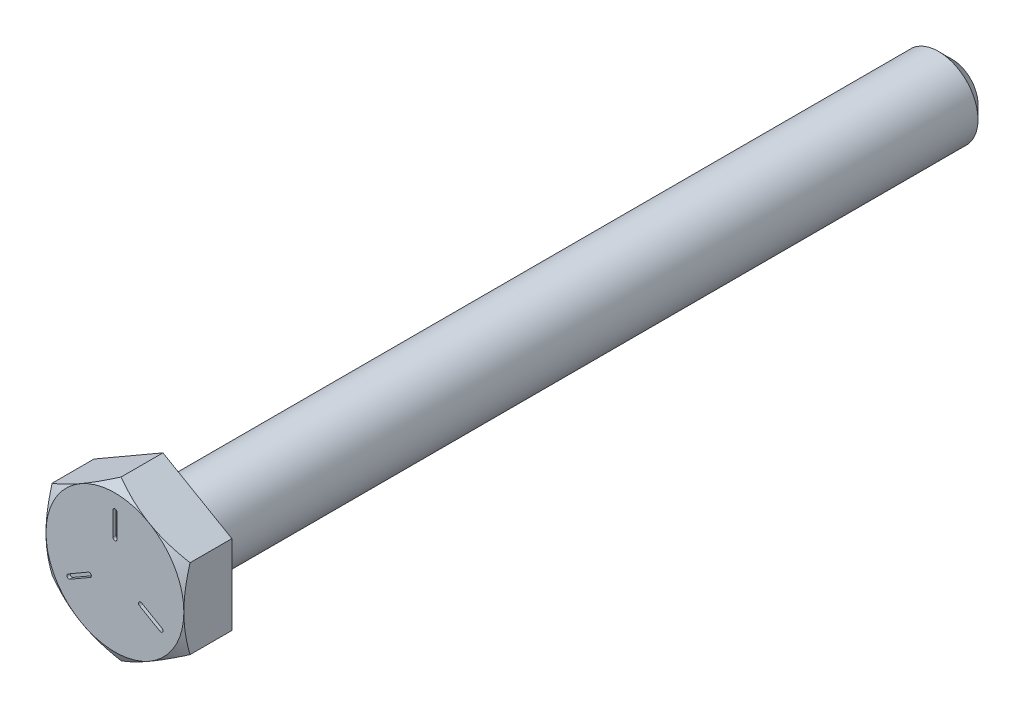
ISO-10303-21;
HEADER;
FILE_DESCRIPTION(('STEP AP214'),'2;1');
FILE_NAME('part.step','',(''),(''),'','','');
FILE_SCHEMA(('AUTOMOTIVE_DESIGN { 1 0 10303 214 1 1 1 1 }'));
ENDSEC;
DATA;
#1=APPLICATION_CONTEXT('core data for automotive mechanical design processes');
#2=APPLICATION_PROTOCOL_DEFINITION('international standard','automotive_design',2000,#1);
#3=PRODUCT_CONTEXT('',#1,'mechanical');
#4=PRODUCT('Part','Part','',(#3));
#5=PRODUCT_RELATED_PRODUCT_CATEGORY('part','',(#4));
#6=PRODUCT_DEFINITION_FORMATION('','',#4);
#7=PRODUCT_DEFINITION_CONTEXT('part definition',#1,'design');
#8=PRODUCT_DEFINITION('design','',#6,#7);
#9=PRODUCT_DEFINITION_SHAPE('','',#8);
#10=(LENGTH_UNIT() NAMED_UNIT(*) SI_UNIT(.MILLI.,.METRE.));
#11=(NAMED_UNIT(*) PLANE_ANGLE_UNIT() SI_UNIT($,.RADIAN.));
#12=(NAMED_UNIT(*) SI_UNIT($,.STERADIAN.) SOLID_ANGLE_UNIT());
#13=UNCERTAINTY_MEASURE_WITH_UNIT(LENGTH_MEASURE(1.E-05),#10,'distance_accuracy_value','');
#14=(GEOMETRIC_REPRESENTATION_CONTEXT(3) GLOBAL_UNCERTAINTY_ASSIGNED_CONTEXT((#13)) GLOBAL_UNIT_ASSIGNED_CONTEXT((#10,
#11,#12)) REPRESENTATION_CONTEXT('',''));
#15=CARTESIAN_POINT('',(0.,0.,0.));
#16=DIRECTION('',(0.,0.,1.));
#17=DIRECTION('',(1.,0.,0.));
#18=AXIS2_PLACEMENT_3D('',#15,#16,#17);
#19=CARTESIAN_POINT('',(-3.7051273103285,-2.13915625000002,33.480375));
#20=DIRECTION('',(0.,0.,1.));
#21=DIRECTION('',(1.,0.,0.));
#22=AXIS2_PLACEMENT_3D('',#19,#20,#21);
#23=PLANE('',#22);
#24=CARTESIAN_POINT('',(-2.06909706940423,-1.19459375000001,33.480375));
#25=DIRECTION('',(0.,0.,1.));
#26=DIRECTION('',(1.,0.,0.));
#27=AXIS2_PLACEMENT_3D('',#24,#25,#26);
#28=CIRCLE('',#27,0.1666875);
#29=CARTESIAN_POINT('',(-1.98575331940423,-1.33894935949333,33.480375));
#30=VERTEX_POINT('',#29);
#31=CARTESIAN_POINT('',(-2.15244081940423,-1.05023814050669,33.480375));
#32=VERTEX_POINT('',#31);
#33=EDGE_CURVE('E170',#30,#32,#28,.T.);
#34=ORIENTED_EDGE('',*,*,#33,.T.);
#35=DIRECTION('',(-0.866025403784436,-0.500000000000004,0.));
#36=VECTOR('',#35,1.);
#37=CARTESIAN_POINT('',(-3.7884710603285,-1.9948006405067,33.480375));
#38=LINE('',#37,#36);
#39=CARTESIAN_POINT('',(-3.7884710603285,-1.9948006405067,33.480375));
#40=VERTEX_POINT('',#39);
#41=EDGE_CURVE('E159',#32,#40,#38,.T.);
#42=ORIENTED_EDGE('',*,*,#41,.T.);
#43=CARTESIAN_POINT('',(-3.7051273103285,-2.13915625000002,33.480375));
#44=DIRECTION('',(0.,0.,1.));
#45=DIRECTION('',(1.,0.,0.));
#46=AXIS2_PLACEMENT_3D('',#43,#44,#45);
#47=CIRCLE('',#46,0.1666875);
#48=CARTESIAN_POINT('',(-3.6217835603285,-2.28351185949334,33.480375));
#49=VERTEX_POINT('',#48);
#50=EDGE_CURVE('E18',#40,#49,#47,.T.);
#51=ORIENTED_EDGE('',*,*,#50,.T.);
#52=DIRECTION('',(0.866025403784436,0.500000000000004,0.));
#53=VECTOR('',#52,1.);
#54=CARTESIAN_POINT('',(-3.6217835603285,-2.28351185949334,33.480375));
#55=LINE('',#54,#53);
#56=EDGE_CURVE('E156',#49,#30,#55,.T.);
#57=ORIENTED_EDGE('',*,*,#56,.T.);
#58=EDGE_LOOP('',(#34,#42,#51,#57));
#59=FACE_BOUND('',#58,.T.);
#60=ADVANCED_FACE('F15',(#59),#23,.T.);
#61=CARTESIAN_POINT('',(3.70512731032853,-2.13915624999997,33.480375));
#62=DIRECTION('',(0.,0.,1.));
#63=DIRECTION('',(1.,0.,0.));
#64=AXIS2_PLACEMENT_3D('',#61,#62,#63);
#65=PLANE('',#64);
#66=CARTESIAN_POINT('',(2.06909706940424,-1.19459374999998,33.480375));
#67=DIRECTION('',(0.,0.,1.));
#68=DIRECTION('',(1.,0.,0.));
#69=AXIS2_PLACEMENT_3D('',#66,#67,#68);
#70=CIRCLE('',#69,0.1666875);
#71=CARTESIAN_POINT('',(2.15244081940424,-1.05023814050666,33.480375));
#72=VERTEX_POINT('',#71);
#73=CARTESIAN_POINT('',(1.98575331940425,-1.3389493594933,33.480375));
#74=VERTEX_POINT('',#73);
#75=EDGE_CURVE('E289',#72,#74,#70,.T.);
#76=ORIENTED_EDGE('',*,*,#75,.T.);
#77=DIRECTION('',(0.866025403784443,-0.499999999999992,0.));
#78=VECTOR('',#77,1.);
#79=CARTESIAN_POINT('',(3.62178356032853,-2.28351185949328,33.480375));
#80=LINE('',#79,#78);
#81=CARTESIAN_POINT('',(3.62178356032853,-2.28351185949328,33.480375));
#82=VERTEX_POINT('',#81);
#83=EDGE_CURVE('E180',#74,#82,#80,.T.);
#84=ORIENTED_EDGE('',*,*,#83,.T.);
#85=CARTESIAN_POINT('',(3.70512731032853,-2.13915624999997,33.480375));
#86=DIRECTION('',(0.,0.,1.));
#87=DIRECTION('',(1.,0.,0.));
#88=AXIS2_PLACEMENT_3D('',#85,#86,#87);
#89=CIRCLE('',#88,0.1666875);
#90=CARTESIAN_POINT('',(3.78847106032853,-1.99480064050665,33.480375));
#91=VERTEX_POINT('',#90);
#92=EDGE_CURVE('E176',#82,#91,#89,.T.);
#93=ORIENTED_EDGE('',*,*,#92,.T.);
#94=DIRECTION('',(-0.866025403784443,0.499999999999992,0.));
#95=VECTOR('',#94,1.);
#96=CARTESIAN_POINT('',(3.78847106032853,-1.99480064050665,33.480375));
#97=LINE('',#96,#95);
#98=EDGE_CURVE('E306',#91,#72,#97,.T.);
#99=ORIENTED_EDGE('',*,*,#98,.T.);
#100=EDGE_LOOP('',(#76,#84,#93,#99));
#101=FACE_BOUND('',#100,.T.);
#102=ADVANCED_FACE('F325',(#101),#65,.T.);
#103=CARTESIAN_POINT('',(0.,4.2783125,33.480375));
#104=DIRECTION('',(0.,0.,1.));
#105=DIRECTION('',(1.,0.,0.));
#106=AXIS2_PLACEMENT_3D('',#103,#104,#105);
#107=PLANE('',#106);
#108=CARTESIAN_POINT('',(0.,2.3891875,33.480375));
#109=DIRECTION('',(0.,0.,1.));
#110=DIRECTION('',(1.,0.,0.));
#111=AXIS2_PLACEMENT_3D('',#108,#109,#110);
#112=CIRCLE('',#111,0.1666875);
#113=CARTESIAN_POINT('',(-0.1666875,2.3891875,33.480375));
#114=VERTEX_POINT('',#113);
#115=CARTESIAN_POINT('',(0.1666875,2.3891875,33.480375));
#116=VERTEX_POINT('',#115);
#117=EDGE_CURVE('E281',#114,#116,#112,.T.);
#118=ORIENTED_EDGE('',*,*,#117,.T.);
#119=DIRECTION('',(0.,1.,0.));
#120=VECTOR('',#119,1.);
#121=CARTESIAN_POINT('',(0.1666875,4.2783125,33.480375));
#122=LINE('',#121,#120);
#123=CARTESIAN_POINT('',(0.1666875,4.2783125,33.480375));
#124=VERTEX_POINT('',#123);
#125=EDGE_CURVE('E287',#116,#124,#122,.T.);
#126=ORIENTED_EDGE('',*,*,#125,.T.);
#127=CARTESIAN_POINT('',(0.,4.2783125,33.480375));
#128=DIRECTION('',(0.,0.,1.));
#129=DIRECTION('',(1.,0.,0.));
#130=AXIS2_PLACEMENT_3D('',#127,#128,#129);
#131=CIRCLE('',#130,0.1666875);
#132=CARTESIAN_POINT('',(-0.1666875,4.2783125,33.480375));
#133=VERTEX_POINT('',#132);
#134=EDGE_CURVE('E285',#124,#133,#131,.T.);
#135=ORIENTED_EDGE('',*,*,#134,.T.);
#136=DIRECTION('',(0.,-1.,0.));
#137=VECTOR('',#136,1.);
#138=CARTESIAN_POINT('',(-0.1666875,4.2783125,33.480375));
#139=LINE('',#138,#137);
#140=EDGE_CURVE('E303',#133,#114,#139,.T.);
#141=ORIENTED_EDGE('',*,*,#140,.T.);
#142=EDGE_LOOP('',(#118,#126,#135,#141));
#143=FACE_BOUND('',#142,.T.);
#144=ADVANCED_FACE('F446',(#143),#107,.T.);
#145=CARTESIAN_POINT('',(-3.7051273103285,-2.13915625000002,33.480375));
#146=DIRECTION('',(0.,0.,1.));
#147=DIRECTION('',(1.,0.,0.));
#148=AXIS2_PLACEMENT_3D('',#145,#146,#147);
#149=CYLINDRICAL_SURFACE('',#148,0.1666875);
#150=DIRECTION('',(0.,0.,1.));
#151=VECTOR('',#150,1.);
#152=CARTESIAN_POINT('',(-3.6217835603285,-2.28351185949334,33.480375));
#153=LINE('',#152,#151);
#154=CARTESIAN_POINT('',(-3.6217835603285,-2.28351185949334,33.734375));
#155=VERTEX_POINT('',#154);
#156=EDGE_CURVE('E163',#155,#49,#153,.F.);
#157=ORIENTED_EDGE('',*,*,#156,.T.);
#158=ORIENTED_EDGE('',*,*,#50,.F.);
#159=DIRECTION('',(0.,0.,1.));
#160=VECTOR('',#159,1.);
#161=CARTESIAN_POINT('',(-3.7884710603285,-1.9948006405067,33.480375));
#162=LINE('',#161,#160);
#163=CARTESIAN_POINT('',(-3.7884710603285,-1.9948006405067,33.734375));
#164=VERTEX_POINT('',#163);
#165=EDGE_CURVE('E183',#40,#164,#162,.T.);
#166=ORIENTED_EDGE('',*,*,#165,.T.);
#167=CARTESIAN_POINT('',(-3.7051273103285,-2.13915625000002,33.734375));
#168=DIRECTION('',(0.,0.,1.));
#169=DIRECTION('',(1.,0.,0.));
#170=AXIS2_PLACEMENT_3D('',#167,#168,#169);
#171=CIRCLE('',#170,0.1666875);
#172=EDGE_CURVE('E166',#155,#164,#171,.F.);
#173=ORIENTED_EDGE('',*,*,#172,.F.);
#174=EDGE_LOOP('',(#157,#158,#166,#173));
#175=FACE_BOUND('',#174,.T.);
#176=ADVANCED_FACE('F164',(#175),#149,.F.);
#177=CARTESIAN_POINT('',(-3.7884710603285,-1.9948006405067,33.480375));
#178=DIRECTION('',(-0.500000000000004,0.866025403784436,0.));
#179=DIRECTION('',(-0.866025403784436,-0.500000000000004,0.));
#180=AXIS2_PLACEMENT_3D('',#177,#178,#179);
#181=PLANE('',#180);
#182=ORIENTED_EDGE('',*,*,#165,.F.);
#183=ORIENTED_EDGE('',*,*,#41,.F.);
#184=DIRECTION('',(0.,0.,1.));
#185=VECTOR('',#184,1.);
#186=CARTESIAN_POINT('',(-2.15244081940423,-1.05023814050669,33.480375));
#187=LINE('',#186,#185);
#188=CARTESIAN_POINT('',(-2.15244081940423,-1.05023814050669,33.734375));
#189=VERTEX_POINT('',#188);
#190=EDGE_CURVE('E294',#32,#189,#187,.T.);
#191=ORIENTED_EDGE('',*,*,#190,.T.);
#192=DIRECTION('',(0.866025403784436,0.500000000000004,0.));
#193=VECTOR('',#192,1.);
#194=CARTESIAN_POINT('',(-3.7884710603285,-1.9948006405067,33.734375));
#195=LINE('',#194,#193);
#196=EDGE_CURVE('E278',#164,#189,#195,.T.);
#197=ORIENTED_EDGE('',*,*,#196,.F.);
#198=EDGE_LOOP('',(#182,#183,#191,#197));
#199=FACE_BOUND('',#198,.T.);
#200=ADVANCED_FACE('F453',(#199),#181,.F.);
#201=CARTESIAN_POINT('',(-2.06909706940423,-1.19459375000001,33.480375));
#202=DIRECTION('',(0.,0.,1.));
#203=DIRECTION('',(1.,0.,0.));
#204=AXIS2_PLACEMENT_3D('',#201,#202,#203);
#205=CYLINDRICAL_SURFACE('',#204,0.1666875);
#206=ORIENTED_EDGE('',*,*,#33,.F.);
#207=DIRECTION('',(0.,0.,1.));
#208=VECTOR('',#207,1.);
#209=CARTESIAN_POINT('',(-1.98575331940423,-1.33894935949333,33.480375));
#210=LINE('',#209,#208);
#211=CARTESIAN_POINT('',(-1.98575331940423,-1.33894935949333,33.734375));
#212=VERTEX_POINT('',#211);
#213=EDGE_CURVE('E174',#30,#212,#210,.T.);
#214=ORIENTED_EDGE('',*,*,#213,.T.);
#215=CARTESIAN_POINT('',(-2.06909706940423,-1.19459375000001,33.734375));
#216=DIRECTION('',(0.,0.,1.));
#217=DIRECTION('',(1.,0.,0.));
#218=AXIS2_PLACEMENT_3D('',#215,#216,#217);
#219=CIRCLE('',#218,0.1666875);
#220=EDGE_CURVE('E274',#189,#212,#219,.F.);
#221=ORIENTED_EDGE('',*,*,#220,.F.);
#222=ORIENTED_EDGE('',*,*,#190,.F.);
#223=EDGE_LOOP('',(#206,#214,#221,#222));
#224=FACE_BOUND('',#223,.T.);
#225=ADVANCED_FACE('F458',(#224),#205,.F.);
#226=CARTESIAN_POINT('',(-3.6217835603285,-2.28351185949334,33.480375));
#227=DIRECTION('',(0.500000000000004,-0.866025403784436,0.));
#228=DIRECTION('',(0.866025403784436,0.500000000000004,0.));
#229=AXIS2_PLACEMENT_3D('',#226,#227,#228);
#230=PLANE('',#229);
#231=ORIENTED_EDGE('',*,*,#213,.F.);
#232=ORIENTED_EDGE('',*,*,#56,.F.);
#233=ORIENTED_EDGE('',*,*,#156,.F.);
#234=DIRECTION('',(-0.866025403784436,-0.500000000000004,0.));
#235=VECTOR('',#234,1.);
#236=CARTESIAN_POINT('',(-1.98575331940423,-1.33894935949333,33.734375));
#237=LINE('',#236,#235);
#238=EDGE_CURVE('E277',#212,#155,#237,.T.);
#239=ORIENTED_EDGE('',*,*,#238,.F.);
#240=EDGE_LOOP('',(#231,#232,#233,#239));
#241=FACE_BOUND('',#240,.T.);
#242=ADVANCED_FACE('F173',(#241),#230,.F.);
#243=CARTESIAN_POINT('',(3.62178356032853,-2.28351185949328,33.480375));
#244=DIRECTION('',(-0.499999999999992,-0.866025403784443,0.));
#245=DIRECTION('',(0.866025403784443,-0.499999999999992,0.));
#246=AXIS2_PLACEMENT_3D('',#243,#244,#245);
#247=PLANE('',#246);
#248=DIRECTION('',(0.,0.,1.));
#249=VECTOR('',#248,1.);
#250=CARTESIAN_POINT('',(3.62178356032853,-2.28351185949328,33.480375));
#251=LINE('',#250,#249);
#252=CARTESIAN_POINT('',(3.62178356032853,-2.28351185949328,33.734375));
#253=VERTEX_POINT('',#252);
#254=EDGE_CURVE('E292',#82,#253,#251,.T.);
#255=ORIENTED_EDGE('',*,*,#254,.F.);
#256=ORIENTED_EDGE('',*,*,#83,.F.);
#257=DIRECTION('',(0.,0.,1.));
#258=VECTOR('',#257,1.);
#259=CARTESIAN_POINT('',(1.98575331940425,-1.3389493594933,33.480375));
#260=LINE('',#259,#258);
#261=CARTESIAN_POINT('',(1.98575331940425,-1.3389493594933,33.734375));
#262=VERTEX_POINT('',#261);
#263=EDGE_CURVE('E291',#74,#262,#260,.T.);
#264=ORIENTED_EDGE('',*,*,#263,.T.);
#265=DIRECTION('',(-0.866025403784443,0.499999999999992,0.));
#266=VECTOR('',#265,1.);
#267=CARTESIAN_POINT('',(3.62178356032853,-2.28351185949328,33.734375));
#268=LINE('',#267,#266);
#269=EDGE_CURVE('E273',#253,#262,#268,.T.);
#270=ORIENTED_EDGE('',*,*,#269,.F.);
#271=EDGE_LOOP('',(#255,#256,#264,#270));
#272=FACE_BOUND('',#271,.T.);
#273=ADVANCED_FACE('F328',(#272),#247,.F.);
#274=CARTESIAN_POINT('',(2.06909706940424,-1.19459374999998,33.480375));
#275=DIRECTION('',(0.,0.,1.));
#276=DIRECTION('',(1.,0.,0.));
#277=AXIS2_PLACEMENT_3D('',#274,#275,#276);
#278=CYLINDRICAL_SURFACE('',#277,0.1666875);
#279=ORIENTED_EDGE('',*,*,#263,.F.);
#280=ORIENTED_EDGE('',*,*,#75,.F.);
#281=DIRECTION('',(0.,0.,1.));
#282=VECTOR('',#281,1.);
#283=CARTESIAN_POINT('',(2.15244081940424,-1.05023814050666,33.480375));
#284=LINE('',#283,#282);
#285=CARTESIAN_POINT('',(2.15244081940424,-1.05023814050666,33.734375));
#286=VERTEX_POINT('',#285);
#287=EDGE_CURVE('E307',#72,#286,#284,.T.);
#288=ORIENTED_EDGE('',*,*,#287,.T.);
#289=CARTESIAN_POINT('',(2.06909706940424,-1.19459374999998,33.734375));
#290=DIRECTION('',(0.,0.,1.));
#291=DIRECTION('',(1.,0.,0.));
#292=AXIS2_PLACEMENT_3D('',#289,#290,#291);
#293=CIRCLE('',#292,0.1666875);
#294=EDGE_CURVE('E270',#262,#286,#293,.F.);
#295=ORIENTED_EDGE('',*,*,#294,.F.);
#296=EDGE_LOOP('',(#279,#280,#288,#295));
#297=FACE_BOUND('',#296,.T.);
#298=ADVANCED_FACE('F349',(#297),#278,.F.);
#299=CARTESIAN_POINT('',(3.78847106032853,-1.99480064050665,33.480375));
#300=DIRECTION('',(0.499999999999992,0.866025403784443,0.));
#301=DIRECTION('',(-0.866025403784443,0.499999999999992,0.));
#302=AXIS2_PLACEMENT_3D('',#299,#300,#301);
#303=PLANE('',#302);
#304=ORIENTED_EDGE('',*,*,#287,.F.);
#305=ORIENTED_EDGE('',*,*,#98,.F.);
#306=DIRECTION('',(0.,0.,1.));
#307=VECTOR('',#306,1.);
#308=CARTESIAN_POINT('',(3.78847106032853,-1.99480064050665,33.480375));
#309=LINE('',#308,#307);
#310=CARTESIAN_POINT('',(3.78847106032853,-1.99480064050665,33.734375));
#311=VERTEX_POINT('',#310);
#312=EDGE_CURVE('E288',#91,#311,#309,.T.);
#313=ORIENTED_EDGE('',*,*,#312,.T.);
#314=DIRECTION('',(0.866025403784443,-0.499999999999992,0.));
#315=VECTOR('',#314,1.);
#316=CARTESIAN_POINT('',(2.15244081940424,-1.05023814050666,33.734375));
#317=LINE('',#316,#315);
#318=EDGE_CURVE('E269',#286,#311,#317,.T.);
#319=ORIENTED_EDGE('',*,*,#318,.F.);
#320=EDGE_LOOP('',(#304,#305,#313,#319));
#321=FACE_BOUND('',#320,.T.);
#322=ADVANCED_FACE('F344',(#321),#303,.F.);
#323=CARTESIAN_POINT('',(3.70512731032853,-2.13915624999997,33.480375));
#324=DIRECTION('',(0.,0.,1.));
#325=DIRECTION('',(1.,0.,0.));
#326=AXIS2_PLACEMENT_3D('',#323,#324,#325);
#327=CYLINDRICAL_SURFACE('',#326,0.1666875);
#328=ORIENTED_EDGE('',*,*,#312,.F.);
#329=ORIENTED_EDGE('',*,*,#92,.F.);
#330=ORIENTED_EDGE('',*,*,#254,.T.);
#331=CARTESIAN_POINT('',(3.70512731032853,-2.13915624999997,33.734375));
#332=DIRECTION('',(0.,0.,1.));
#333=DIRECTION('',(1.,0.,0.));
#334=AXIS2_PLACEMENT_3D('',#331,#332,#333);
#335=CIRCLE('',#334,0.1666875);
#336=EDGE_CURVE('E267',#311,#253,#335,.F.);
#337=ORIENTED_EDGE('',*,*,#336,.F.);
#338=EDGE_LOOP('',(#328,#329,#330,#337));
#339=FACE_BOUND('',#338,.T.);
#340=ADVANCED_FACE('F327',(#339),#327,.F.);
#341=CARTESIAN_POINT('',(0.,4.2783125,33.480375));
#342=DIRECTION('',(0.,0.,1.));
#343=DIRECTION('',(1.,0.,0.));
#344=AXIS2_PLACEMENT_3D('',#341,#342,#343);
#345=CYLINDRICAL_SURFACE('',#344,0.1666875);
#346=DIRECTION('',(0.,0.,1.));
#347=VECTOR('',#346,1.);
#348=CARTESIAN_POINT('',(-0.1666875,4.2783125,33.480375));
#349=LINE('',#348,#347);
#350=CARTESIAN_POINT('',(-0.1666875,4.2783125,33.734375));
#351=VERTEX_POINT('',#350);
#352=EDGE_CURVE('E305',#351,#133,#349,.F.);
#353=ORIENTED_EDGE('',*,*,#352,.T.);
#354=ORIENTED_EDGE('',*,*,#134,.F.);
#355=DIRECTION('',(0.,0.,1.));
#356=VECTOR('',#355,1.);
#357=CARTESIAN_POINT('',(0.1666875,4.2783125,33.480375));
#358=LINE('',#357,#356);
#359=CARTESIAN_POINT('',(0.1666875,4.2783125,33.734375));
#360=VERTEX_POINT('',#359);
#361=EDGE_CURVE('E284',#124,#360,#358,.T.);
#362=ORIENTED_EDGE('',*,*,#361,.T.);
#363=CARTESIAN_POINT('',(0.,4.2783125,33.734375));
#364=DIRECTION('',(0.,0.,1.));
#365=DIRECTION('',(1.,0.,0.));
#366=AXIS2_PLACEMENT_3D('',#363,#364,#365);
#367=CIRCLE('',#366,0.1666875);
#368=EDGE_CURVE('E264',#351,#360,#367,.F.);
#369=ORIENTED_EDGE('',*,*,#368,.F.);
#370=EDGE_LOOP('',(#353,#354,#362,#369));
#371=FACE_BOUND('',#370,.T.);
#372=ADVANCED_FACE('F444',(#371),#345,.F.);
#373=CARTESIAN_POINT('',(0.1666875,4.2783125,33.480375));
#374=DIRECTION('',(1.,0.,0.));
#375=DIRECTION('',(0.,1.,0.));
#376=AXIS2_PLACEMENT_3D('',#373,#374,#375);
#377=PLANE('',#376);
#378=ORIENTED_EDGE('',*,*,#361,.F.);
#379=ORIENTED_EDGE('',*,*,#125,.F.);
#380=DIRECTION('',(0.,0.,1.));
#381=VECTOR('',#380,1.);
#382=CARTESIAN_POINT('',(0.1666875,2.3891875,33.480375));
#383=LINE('',#382,#381);
#384=CARTESIAN_POINT('',(0.1666875,2.3891875,33.734375));
#385=VERTEX_POINT('',#384);
#386=EDGE_CURVE('E283',#116,#385,#383,.T.);
#387=ORIENTED_EDGE('',*,*,#386,.T.);
#388=DIRECTION('',(0.,1.,0.));
#389=VECTOR('',#388,1.);
#390=CARTESIAN_POINT('',(0.1666875,0.,33.734375));
#391=LINE('',#390,#389);
#392=EDGE_CURVE('E263',#360,#385,#391,.F.);
#393=ORIENTED_EDGE('',*,*,#392,.F.);
#394=EDGE_LOOP('',(#378,#379,#387,#393));
#395=FACE_BOUND('',#394,.T.);
#396=ADVANCED_FACE('F430',(#395),#377,.F.);
#397=CARTESIAN_POINT('',(0.,2.3891875,33.480375));
#398=DIRECTION('',(0.,0.,1.));
#399=DIRECTION('',(1.,0.,0.));
#400=AXIS2_PLACEMENT_3D('',#397,#398,#399);
#401=CYLINDRICAL_SURFACE('',#400,0.1666875);
#402=ORIENTED_EDGE('',*,*,#386,.F.);
#403=ORIENTED_EDGE('',*,*,#117,.F.);
#404=DIRECTION('',(0.,0.,1.));
#405=VECTOR('',#404,1.);
#406=CARTESIAN_POINT('',(-0.1666875,2.3891875,33.480375));
#407=LINE('',#406,#405);
#408=CARTESIAN_POINT('',(-0.1666875,2.3891875,33.734375));
#409=VERTEX_POINT('',#408);
#410=EDGE_CURVE('E280',#114,#409,#407,.T.);
#411=ORIENTED_EDGE('',*,*,#410,.T.);
#412=CARTESIAN_POINT('',(0.,2.3891875,33.734375));
#413=DIRECTION('',(0.,0.,1.));
#414=DIRECTION('',(1.,0.,0.));
#415=AXIS2_PLACEMENT_3D('',#412,#413,#414);
#416=CIRCLE('',#415,0.1666875);
#417=EDGE_CURVE('E260',#385,#409,#416,.F.);
#418=ORIENTED_EDGE('',*,*,#417,.F.);
#419=EDGE_LOOP('',(#402,#403,#411,#418));
#420=FACE_BOUND('',#419,.T.);
#421=ADVANCED_FACE('F435',(#420),#401,.F.);
#422=CARTESIAN_POINT('',(-0.1666875,4.2783125,33.480375));
#423=DIRECTION('',(-1.,0.,0.));
#424=DIRECTION('',(0.,-1.,0.));
#425=AXIS2_PLACEMENT_3D('',#422,#423,#424);
#426=PLANE('',#425);
#427=ORIENTED_EDGE('',*,*,#410,.F.);
#428=ORIENTED_EDGE('',*,*,#140,.F.);
#429=ORIENTED_EDGE('',*,*,#352,.F.);
#430=DIRECTION('',(0.,1.,0.));
#431=VECTOR('',#430,1.);
#432=CARTESIAN_POINT('',(-0.1666875,0.,33.734375));
#433=LINE('',#432,#431);
#434=EDGE_CURVE('E259',#409,#351,#433,.T.);
#435=ORIENTED_EDGE('',*,*,#434,.F.);
#436=EDGE_LOOP('',(#427,#428,#429,#435));
#437=FACE_BOUND('',#436,.T.);
#438=ADVANCED_FACE('F441',(#437),#426,.F.);
#439=CARTESIAN_POINT('',(0.,0.,33.734375));
#440=DIRECTION('',(0.,0.,1.));
#441=DIRECTION('',(1.,0.,0.));
#442=AXIS2_PLACEMENT_3D('',#439,#440,#441);
#443=PLANE('',#442);
#444=CARTESIAN_POINT('',(0.,0.,33.7343749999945));
#445=DIRECTION('',(0.,0.,-1.));
#446=DIRECTION('',(-1.,0.,0.));
#447=AXIS2_PLACEMENT_3D('',#444,#445,#446);
#448=CIRCLE('',#447,5.55624999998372);
#449=CARTESIAN_POINT('',(-2.77812499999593,-4.81185364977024,33.7343749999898));
#450=VERTEX_POINT('',#449);
#451=CARTESIAN_POINT('',(-5.55624999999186,0.,33.7343749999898));
#452=VERTEX_POINT('',#451);
#453=EDGE_CURVE('E250',#450,#452,#448,.T.);
#454=ORIENTED_EDGE('',*,*,#453,.F.);
#455=CARTESIAN_POINT('',(0.,0.,33.7343749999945));
#456=DIRECTION('',(0.,0.,-1.));
#457=DIRECTION('',(-1.,0.,0.));
#458=AXIS2_PLACEMENT_3D('',#455,#456,#457);
#459=CIRCLE('',#458,5.55624999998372);
#460=CARTESIAN_POINT('',(2.77812499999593,-4.81185364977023,33.7343749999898));
#461=VERTEX_POINT('',#460);
#462=EDGE_CURVE('E253',#461,#450,#459,.T.);
#463=ORIENTED_EDGE('',*,*,#462,.F.);
#464=CARTESIAN_POINT('',(0.,0.,33.7343749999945));
#465=DIRECTION('',(0.,0.,-1.));
#466=DIRECTION('',(-1.,0.,0.));
#467=AXIS2_PLACEMENT_3D('',#464,#465,#466);
#468=CIRCLE('',#467,5.55624999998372);
#469=CARTESIAN_POINT('',(5.55624999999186,0.,33.7343749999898));
#470=VERTEX_POINT('',#469);
#471=EDGE_CURVE('E256',#470,#461,#468,.T.);
#472=ORIENTED_EDGE('',*,*,#471,.F.);
#473=CARTESIAN_POINT('',(0.,0.,33.7343749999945));
#474=DIRECTION('',(0.,0.,-1.));
#475=DIRECTION('',(-1.,0.,0.));
#476=AXIS2_PLACEMENT_3D('',#473,#474,#475);
#477=CIRCLE('',#476,5.55624999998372);
#478=CARTESIAN_POINT('',(2.77812499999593,4.81185364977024,33.7343749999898));
#479=VERTEX_POINT('',#478);
#480=EDGE_CURVE('E236',#479,#470,#477,.T.);
#481=ORIENTED_EDGE('',*,*,#480,.F.);
#482=CARTESIAN_POINT('',(0.,0.,33.7343749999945));
#483=DIRECTION('',(0.,0.,-1.));
#484=DIRECTION('',(-1.,0.,0.));
#485=AXIS2_PLACEMENT_3D('',#482,#483,#484);
#486=CIRCLE('',#485,5.55624999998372);
#487=CARTESIAN_POINT('',(-2.77812499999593,4.81185364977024,33.7343749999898));
#488=VERTEX_POINT('',#487);
#489=EDGE_CURVE('E244',#488,#479,#486,.T.);
#490=ORIENTED_EDGE('',*,*,#489,.F.);
#491=CARTESIAN_POINT('',(0.,0.,33.7343749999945));
#492=DIRECTION('',(0.,0.,-1.));
#493=DIRECTION('',(-1.,0.,0.));
#494=AXIS2_PLACEMENT_3D('',#491,#492,#493);
#495=CIRCLE('',#494,5.55624999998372);
#496=EDGE_CURVE('E247',#452,#488,#495,.T.);
#497=ORIENTED_EDGE('',*,*,#496,.F.);
#498=EDGE_LOOP('',(#454,#463,#472,#481,#490,#497));
#499=FACE_BOUND('',#498,.T.);
#500=ORIENTED_EDGE('',*,*,#417,.T.);
#501=ORIENTED_EDGE('',*,*,#434,.T.);
#502=ORIENTED_EDGE('',*,*,#368,.T.);
#503=ORIENTED_EDGE('',*,*,#392,.T.);
#504=EDGE_LOOP('',(#500,#501,#502,#503));
#505=FACE_BOUND('',#504,.T.);
#506=ORIENTED_EDGE('',*,*,#318,.T.);
#507=ORIENTED_EDGE('',*,*,#336,.T.);
#508=ORIENTED_EDGE('',*,*,#269,.T.);
#509=ORIENTED_EDGE('',*,*,#294,.T.);
#510=EDGE_LOOP('',(#506,#507,#508,#509));
#511=FACE_BOUND('',#510,.T.);
#512=ORIENTED_EDGE('',*,*,#220,.T.);
#513=ORIENTED_EDGE('',*,*,#238,.T.);
#514=ORIENTED_EDGE('',*,*,#172,.T.);
#515=ORIENTED_EDGE('',*,*,#196,.T.);
#516=EDGE_LOOP('',(#512,#513,#514,#515));
#517=FACE_BOUND('',#516,.T.);
#518=ADVANCED_FACE('F346',(#499,#505,#511,#517),#443,.T.);
#519=CARTESIAN_POINT('',(0.,0.,33.2351331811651));
#520=DIRECTION('',(0.,0.,-1.));
#521=DIRECTION('',(-1.,0.,0.));
#522=AXIS2_PLACEMENT_3D('',#519,#520,#521);
#523=CONICAL_SURFACE('',#522,6.42096219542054,1.04719755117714);
#524=CARTESIAN_POINT('',(5.5562499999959,-3.20790243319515,33.238110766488));
#525=CARTESIAN_POINT('',(5.3301118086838,-3.33846337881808,33.3135090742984));
#526=CARTESIAN_POINT('',(5.10216262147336,-3.47006990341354,33.3825870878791));
#527=CARTESIAN_POINT('',(4.64425489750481,-3.73444305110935,33.5044049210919));
#528=CARTESIAN_POINT('',(4.41431233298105,-3.86720045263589,33.5572255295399));
#529=CARTESIAN_POINT('',(4.06722838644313,-4.06758946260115,33.6220802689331));
#530=CARTESIAN_POINT('',(3.9510952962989,-4.13463893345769,33.6413103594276));
#531=CARTESIAN_POINT('',(3.71827313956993,-4.26905886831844,33.6745980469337));
#532=CARTESIAN_POINT('',(3.60158408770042,-4.3364293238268,33.6886557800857));
#533=CARTESIAN_POINT('',(3.36721838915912,-4.47174042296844,33.7113517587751));
#534=CARTESIAN_POINT('',(3.24953972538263,-4.53968223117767,33.7199624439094));
#535=CARTESIAN_POINT('',(3.01395096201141,-4.67569946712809,33.7314859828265));
#536=CARTESIAN_POINT('',(2.89604082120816,-4.74377491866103,33.7343977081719));
#537=CARTESIAN_POINT('',(2.778125,-4.81185364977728,33.7343749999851));
#538=B_SPLINE_CURVE_WITH_KNOTS('',3,(#524,#525,#526,#527,#528,#529,#530,#531,#532,#533,#534,
#535,#536,#537),.UNSPECIFIED.,.F.,.F.,(4,2,2,2,2,2,4),(0.,0.815698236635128,1.62727497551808,
2.03359582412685,2.43990597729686,2.8482558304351,3.25668653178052),.UNSPECIFIED.);
#539=CARTESIAN_POINT('',(5.55624999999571,-3.20790243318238,33.2381107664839));
#540=VERTEX_POINT('',#539);
#541=EDGE_CURVE('E731',#540,#461,#538,.T.);
#542=ORIENTED_EDGE('',*,*,#541,.F.);
#543=CARTESIAN_POINT('',(5.55625,0.,33.7343749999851));
#544=CARTESIAN_POINT('',(5.55625,-0.136157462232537,33.7343977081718));
#545=CARTESIAN_POINT('',(5.55625,-0.272308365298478,33.7314859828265));
#546=CARTESIAN_POINT('',(5.55625,-0.544342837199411,33.7199624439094));
#547=CARTESIAN_POINT('',(5.55625,-0.680226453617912,33.7113517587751));
#548=CARTESIAN_POINT('',(5.55625,-0.950848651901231,33.6886557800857));
#549=CARTESIAN_POINT('',(5.55625,-1.08558956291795,33.6745980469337));
#550=CARTESIAN_POINT('',(5.55625,-1.35442943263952,33.6413103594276));
#551=CARTESIAN_POINT('',(5.55625,-1.48852837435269,33.6220802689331));
#552=CARTESIAN_POINT('',(5.55625,-1.88930639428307,33.5572255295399));
#553=CARTESIAN_POINT('',(5.55625,-2.15482119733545,33.5044049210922));
#554=CARTESIAN_POINT('',(5.55625,-2.68356749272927,33.3825870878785));
#555=CARTESIAN_POINT('',(5.55625,-2.94678054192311,33.3135090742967));
#556=CARTESIAN_POINT('',(5.55625,-3.20790243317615,33.2381107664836));
#557=B_SPLINE_CURVE_WITH_KNOTS('',3,(#543,#544,#545,#546,#547,#548,#549,#550,#551,#552,#553,
#554,#555,#556),.UNSPECIFIED.,.F.,.F.,(4,2,2,2,2,2,4),(0.,0.40843070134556,0.816780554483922,
1.22309070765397,1.62941155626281,2.44098829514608,3.25668653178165),.UNSPECIFIED.);
#558=EDGE_CURVE('E235',#470,#540,#557,.T.);
#559=ORIENTED_EDGE('',*,*,#558,.F.);
#560=ORIENTED_EDGE('',*,*,#471,.T.);
#561=EDGE_LOOP('',(#542,#559,#560));
#562=FACE_BOUND('',#561,.T.);
#563=ADVANCED_FACE('F535',(#562),#523,.T.);
#564=CARTESIAN_POINT('',(0.,0.,33.2351331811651));
#565=DIRECTION('',(0.,0.,-1.));
#566=DIRECTION('',(-1.,0.,0.));
#567=AXIS2_PLACEMENT_3D('',#564,#565,#566);
#568=CONICAL_SURFACE('',#567,6.42096219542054,1.04719755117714);
#569=CARTESIAN_POINT('',(-1.09697450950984E-11,-6.41580486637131,33.238110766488));
#570=CARTESIAN_POINT('',(-0.226138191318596,-6.28524392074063,33.3135090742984));
#571=CARTESIAN_POINT('',(-0.454087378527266,-6.15363739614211,33.3825870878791));
#572=CARTESIAN_POINT('',(-0.911995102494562,-5.88926424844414,33.5044049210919));
#573=CARTESIAN_POINT('',(-1.14193766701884,-5.75650684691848,33.5572255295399));
#574=CARTESIAN_POINT('',(-1.48902161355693,-5.55611783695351,33.6220802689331));
#575=CARTESIAN_POINT('',(-1.60515470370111,-5.4890683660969,33.6413103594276));
#576=CARTESIAN_POINT('',(-1.83797686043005,-5.3546484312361,33.6745980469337));
#577=CARTESIAN_POINT('',(-1.95466591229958,-5.28727797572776,33.6886557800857));
#578=CARTESIAN_POINT('',(-2.18903161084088,-5.15196687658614,33.7113517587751));
#579=CARTESIAN_POINT('',(-2.30671027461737,-5.0840250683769,33.7199624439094));
#580=CARTESIAN_POINT('',(-2.54229903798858,-4.94800783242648,33.7314859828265));
#581=CARTESIAN_POINT('',(-2.66020917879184,-4.87993238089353,33.7343977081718));
#582=CARTESIAN_POINT('',(-2.778125,-4.81185364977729,33.7343749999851));
#583=B_SPLINE_CURVE_WITH_KNOTS('',3,(#569,#570,#571,#572,#573,#574,#575,#576,#577,#578,#579,
#580,#581,#582),.UNSPECIFIED.,.F.,.F.,(4,2,2,2,2,2,4),(0.,0.815698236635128,1.62727497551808,
2.03359582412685,2.43990597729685,2.8482558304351,3.25668653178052),.UNSPECIFIED.);
#584=CARTESIAN_POINT('',(0.,-6.41580486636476,33.2381107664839));
#585=VERTEX_POINT('',#584);
#586=EDGE_CURVE('E715',#585,#450,#583,.T.);
#587=ORIENTED_EDGE('',*,*,#586,.F.);
#588=CARTESIAN_POINT('',(2.778125,-4.81185364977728,33.7343749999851));
#589=CARTESIAN_POINT('',(2.6602091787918,-4.87993238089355,33.7343977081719));
#590=CARTESIAN_POINT('',(2.54229903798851,-4.94800783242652,33.7314859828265));
#591=CARTESIAN_POINT('',(2.30671027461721,-5.08402506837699,33.7199624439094));
#592=CARTESIAN_POINT('',(2.18903161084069,-5.15196687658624,33.7113517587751));
#593=CARTESIAN_POINT('',(1.95466591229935,-5.2872779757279,33.6886557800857));
#594=CARTESIAN_POINT('',(1.83797686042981,-5.35464843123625,33.6745980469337));
#595=CARTESIAN_POINT('',(1.60515470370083,-5.48906836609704,33.6413103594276));
#596=CARTESIAN_POINT('',(1.48902161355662,-5.55611783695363,33.6220802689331));
#597=CARTESIAN_POINT('',(1.14193766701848,-5.75650684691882,33.5572255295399));
#598=CARTESIAN_POINT('',(0.911995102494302,-5.88926424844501,33.5044049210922));
#599=CARTESIAN_POINT('',(0.454087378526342,-6.15363739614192,33.3825870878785));
#600=CARTESIAN_POINT('',(0.226138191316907,-6.28524392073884,33.3135090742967));
#601=CARTESIAN_POINT('',(7.54003390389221E-12,-6.41580486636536,33.2381107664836));
#602=B_SPLINE_CURVE_WITH_KNOTS('',3,(#588,#589,#590,#591,#592,#593,#594,#595,#596,#597,#598,
#599,#600,#601),.UNSPECIFIED.,.F.,.F.,(4,2,2,2,2,2,4),(0.,0.40843070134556,0.816780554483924,
1.22309070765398,1.62941155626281,2.44098829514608,3.25668653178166),.UNSPECIFIED.);
#603=EDGE_CURVE('E725',#461,#585,#602,.T.);
#604=ORIENTED_EDGE('',*,*,#603,.F.);
#605=ORIENTED_EDGE('',*,*,#462,.T.);
#606=EDGE_LOOP('',(#587,#604,#605));
#607=FACE_BOUND('',#606,.T.);
#608=ADVANCED_FACE('F545',(#607),#568,.T.);
#609=CARTESIAN_POINT('',(0.,0.,33.2351331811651));
#610=DIRECTION('',(0.,0.,-1.));
#611=DIRECTION('',(-1.,0.,0.));
#612=AXIS2_PLACEMENT_3D('',#609,#610,#611);
#613=CONICAL_SURFACE('',#612,6.42096219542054,1.04719755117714);
#614=CARTESIAN_POINT('',(-5.55625000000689,-3.20790243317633,33.238110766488));
#615=CARTESIAN_POINT('',(-5.55625000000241,-2.9467805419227,33.3135090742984));
#616=CARTESIAN_POINT('',(-5.55625000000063,-2.6835674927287,33.382587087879));
#617=CARTESIAN_POINT('',(-5.55624999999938,-2.1548211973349,33.5044049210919));
#618=CARTESIAN_POINT('',(-5.55624999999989,-1.88930639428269,33.5572255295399));
#619=CARTESIAN_POINT('',(-5.55625000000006,-1.48852837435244,33.6220802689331));
#620=CARTESIAN_POINT('',(-5.55625000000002,-1.35442943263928,33.6413103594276));
#621=CARTESIAN_POINT('',(-5.55624999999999,-1.08558956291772,33.6745980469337));
#622=CARTESIAN_POINT('',(-5.55625,-0.950848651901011,33.6886557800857));
#623=CARTESIAN_POINT('',(-5.55625000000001,-0.680226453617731,33.7113517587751));
#624=CARTESIAN_POINT('',(-5.55625000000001,-0.544342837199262,33.7199624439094));
#625=CARTESIAN_POINT('',(-5.55625,-0.272308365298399,33.7314859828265));
#626=CARTESIAN_POINT('',(-5.55625,-0.136157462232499,33.7343977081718));
#627=CARTESIAN_POINT('',(-5.55625,0.,33.7343749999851));
#628=B_SPLINE_CURVE_WITH_KNOTS('',3,(#614,#615,#616,#617,#618,#619,#620,#621,#622,#623,#624,
#625,#626,#627),.UNSPECIFIED.,.F.,.F.,(4,2,2,2,2,2,4),(0.,0.815698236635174,1.62727497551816,
2.03359582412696,2.43990597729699,2.84825583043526,3.2566865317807),.UNSPECIFIED.);
#629=CARTESIAN_POINT('',(-5.55624999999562,-3.20790243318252,33.2381107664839));
#630=VERTEX_POINT('',#629);
#631=EDGE_CURVE('E706',#630,#452,#628,.T.);
#632=ORIENTED_EDGE('',*,*,#631,.F.);
#633=CARTESIAN_POINT('',(-2.778125,-4.81185364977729,33.7343749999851));
#634=CARTESIAN_POINT('',(-2.89604082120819,-4.74377491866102,33.7343977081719));
#635=CARTESIAN_POINT('',(-3.01395096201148,-4.67569946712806,33.7314859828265));
#636=CARTESIAN_POINT('',(-3.24953972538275,-4.5396822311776,33.7199624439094));
#637=CARTESIAN_POINT('',(-3.36721838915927,-4.47174042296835,33.7113517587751));
#638=CARTESIAN_POINT('',(-3.6015840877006,-4.3364293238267,33.6886557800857));
#639=CARTESIAN_POINT('',(-3.71827313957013,-4.26905886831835,33.6745980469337));
#640=CARTESIAN_POINT('',(-3.9510952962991,-4.13463893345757,33.6413103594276));
#641=CARTESIAN_POINT('',(-4.0672283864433,-4.06758946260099,33.6220802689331));
#642=CARTESIAN_POINT('',(-4.41431233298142,-3.86720045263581,33.5572255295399));
#643=CARTESIAN_POINT('',(-4.64425489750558,-3.73444305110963,33.5044049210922));
#644=CARTESIAN_POINT('',(-5.10216262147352,-3.47006990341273,33.3825870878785));
#645=CARTESIAN_POINT('',(-5.33011180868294,-3.33846337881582,33.3135090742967));
#646=CARTESIAN_POINT('',(-5.55624999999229,-3.20790243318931,33.2381107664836));
#647=B_SPLINE_CURVE_WITH_KNOTS('',3,(#633,#634,#635,#636,#637,#638,#639,#640,#641,#642,#643,
#644,#645,#646),.UNSPECIFIED.,.F.,.F.,(4,2,2,2,2,2,4),(0.,0.408430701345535,0.816780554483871,
1.2230907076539,1.62941155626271,2.44098829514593,3.25668653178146),.UNSPECIFIED.);
#648=EDGE_CURVE('E701',#450,#630,#647,.T.);
#649=ORIENTED_EDGE('',*,*,#648,.F.);
#650=ORIENTED_EDGE('',*,*,#453,.T.);
#651=EDGE_LOOP('',(#632,#649,#650));
#652=FACE_BOUND('',#651,.T.);
#653=ADVANCED_FACE('F554',(#652),#613,.T.);
#654=CARTESIAN_POINT('',(0.,0.,33.2351331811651));
#655=DIRECTION('',(0.,0.,-1.));
#656=DIRECTION('',(-1.,0.,0.));
#657=AXIS2_PLACEMENT_3D('',#654,#655,#656);
#658=CONICAL_SURFACE('',#657,6.42096219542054,1.04719755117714);
#659=CARTESIAN_POINT('',(-5.5562499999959,3.20790243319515,33.238110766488));
#660=CARTESIAN_POINT('',(-5.3301118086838,3.33846337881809,33.3135090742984));
#661=CARTESIAN_POINT('',(-5.10216262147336,3.47006990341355,33.382587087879));
#662=CARTESIAN_POINT('',(-4.64425489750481,3.73444305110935,33.5044049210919));
#663=CARTESIAN_POINT('',(-4.41431233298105,3.86720045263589,33.5572255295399));
#664=CARTESIAN_POINT('',(-4.06722838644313,4.06758946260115,33.6220802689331));
#665=CARTESIAN_POINT('',(-3.95109529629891,4.13463893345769,33.6413103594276));
#666=CARTESIAN_POINT('',(-3.71827313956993,4.26905886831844,33.6745980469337));
#667=CARTESIAN_POINT('',(-3.60158408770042,4.3364293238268,33.6886557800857));
#668=CARTESIAN_POINT('',(-3.36721838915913,4.47174042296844,33.7113517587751));
#669=CARTESIAN_POINT('',(-3.24953972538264,4.53968223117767,33.7199624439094));
#670=CARTESIAN_POINT('',(-3.01395096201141,4.67569946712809,33.7314859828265));
#671=CARTESIAN_POINT('',(-2.89604082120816,4.74377491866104,33.7343977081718));
#672=CARTESIAN_POINT('',(-2.778125,4.81185364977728,33.7343749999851));
#673=B_SPLINE_CURVE_WITH_KNOTS('',3,(#659,#660,#661,#662,#663,#664,#665,#666,#667,#668,#669,
#670,#671,#672),.UNSPECIFIED.,.F.,.F.,(4,2,2,2,2,2,4),(0.,0.815698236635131,1.62727497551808,
2.03359582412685,2.43990597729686,2.84825583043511,3.25668653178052),.UNSPECIFIED.);
#674=CARTESIAN_POINT('',(-5.55624999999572,3.20790243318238,33.2381107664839));
#675=VERTEX_POINT('',#674);
#676=EDGE_CURVE('E684',#675,#488,#673,.T.);
#677=ORIENTED_EDGE('',*,*,#676,.F.);
#678=CARTESIAN_POINT('',(-5.55625,0.,33.7343749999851));
#679=CARTESIAN_POINT('',(-5.55625,0.136157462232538,33.7343977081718));
#680=CARTESIAN_POINT('',(-5.55625,0.272308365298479,33.7314859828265));
#681=CARTESIAN_POINT('',(-5.55625,0.544342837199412,33.7199624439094));
#682=CARTESIAN_POINT('',(-5.55625,0.680226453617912,33.7113517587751));
#683=CARTESIAN_POINT('',(-5.55625,0.950848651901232,33.6886557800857));
#684=CARTESIAN_POINT('',(-5.55625,1.08558956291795,33.6745980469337));
#685=CARTESIAN_POINT('',(-5.55625,1.35442943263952,33.6413103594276));
#686=CARTESIAN_POINT('',(-5.55625,1.48852837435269,33.6220802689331));
#687=CARTESIAN_POINT('',(-5.55625,1.88930639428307,33.5572255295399));
#688=CARTESIAN_POINT('',(-5.55625,2.15482119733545,33.5044049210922));
#689=CARTESIAN_POINT('',(-5.55625,2.68356749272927,33.3825870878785));
#690=CARTESIAN_POINT('',(-5.55625,2.94678054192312,33.3135090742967));
#691=CARTESIAN_POINT('',(-5.55625,3.20790243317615,33.2381107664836));
#692=B_SPLINE_CURVE_WITH_KNOTS('',3,(#678,#679,#680,#681,#682,#683,#684,#685,#686,#687,#688,
#689,#690,#691),.UNSPECIFIED.,.F.,.F.,(4,2,2,2,2,2,4),(0.,0.40843070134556,0.816780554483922,
1.22309070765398,1.62941155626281,2.44098829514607,3.25668653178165),.UNSPECIFIED.);
#693=EDGE_CURVE('E690',#452,#675,#692,.T.);
#694=ORIENTED_EDGE('',*,*,#693,.F.);
#695=ORIENTED_EDGE('',*,*,#496,.T.);
#696=EDGE_LOOP('',(#677,#694,#695));
#697=FACE_BOUND('',#696,.T.);
#698=ADVANCED_FACE('F564',(#697),#658,.T.);
#699=CARTESIAN_POINT('',(0.,0.,33.2351331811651));
#700=DIRECTION('',(0.,0.,-1.));
#701=DIRECTION('',(-1.,0.,0.));
#702=AXIS2_PLACEMENT_3D('',#699,#700,#701);
#703=CONICAL_SURFACE('',#702,6.42096219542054,1.04719755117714);
#704=ORIENTED_EDGE('',*,*,#489,.T.);
#705=CARTESIAN_POINT('',(1.09652891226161E-11,6.41580486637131,33.238110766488));
#706=CARTESIAN_POINT('',(0.226138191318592,6.28524392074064,33.3135090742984));
#707=CARTESIAN_POINT('',(0.454087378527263,6.15363739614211,33.382587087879));
#708=CARTESIAN_POINT('',(0.91199510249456,5.88926424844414,33.5044049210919));
#709=CARTESIAN_POINT('',(1.14193766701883,5.75650684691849,33.5572255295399));
#710=CARTESIAN_POINT('',(1.48902161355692,5.55611783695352,33.6220802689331));
#711=CARTESIAN_POINT('',(1.6051547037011,5.48906836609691,33.6413103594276));
#712=CARTESIAN_POINT('',(1.83797686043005,5.35464843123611,33.6745980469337));
#713=CARTESIAN_POINT('',(1.95466591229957,5.28727797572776,33.6886557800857));
#714=CARTESIAN_POINT('',(2.18903161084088,5.15196687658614,33.7113517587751));
#715=CARTESIAN_POINT('',(2.30671027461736,5.08402506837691,33.7199624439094));
#716=CARTESIAN_POINT('',(2.54229903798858,4.94800783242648,33.7314859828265));
#717=CARTESIAN_POINT('',(2.66020917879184,4.87993238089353,33.7343977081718));
#718=CARTESIAN_POINT('',(2.77812499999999,4.81185364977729,33.7343749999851));
#719=B_SPLINE_CURVE_WITH_KNOTS('',3,(#705,#706,#707,#708,#709,#710,#711,#712,#713,#714,#715,
#716,#717,#718),.UNSPECIFIED.,.F.,.F.,(4,2,2,2,2,2,4),(0.,0.815698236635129,1.62727497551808,
2.03359582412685,2.43990597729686,2.8482558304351,3.25668653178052),.UNSPECIFIED.);
#720=CARTESIAN_POINT('',(0.,6.41580486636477,33.2381107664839));
#721=VERTEX_POINT('',#720);
#722=EDGE_CURVE('E205',#721,#479,#719,.T.);
#723=ORIENTED_EDGE('',*,*,#722,.F.);
#724=CARTESIAN_POINT('',(-2.778125,4.81185364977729,33.7343749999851));
#725=CARTESIAN_POINT('',(-2.6602091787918,4.87993238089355,33.7343977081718));
#726=CARTESIAN_POINT('',(-2.54229903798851,4.94800783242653,33.7314859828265));
#727=CARTESIAN_POINT('',(-2.30671027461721,5.08402506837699,33.7199624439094));
#728=CARTESIAN_POINT('',(-2.18903161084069,5.15196687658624,33.7113517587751));
#729=CARTESIAN_POINT('',(-1.95466591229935,5.2872779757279,33.6886557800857));
#730=CARTESIAN_POINT('',(-1.83797686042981,5.35464843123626,33.6745980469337));
#731=CARTESIAN_POINT('',(-1.60515470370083,5.48906836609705,33.6413103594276));
#732=CARTESIAN_POINT('',(-1.48902161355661,5.55611783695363,33.6220802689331));
#733=CARTESIAN_POINT('',(-1.14193766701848,5.75650684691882,33.5572255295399));
#734=CARTESIAN_POINT('',(-0.911995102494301,5.88926424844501,33.5044049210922));
#735=CARTESIAN_POINT('',(-0.45408737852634,6.15363739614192,33.3825870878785));
#736=CARTESIAN_POINT('',(-0.226138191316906,6.28524392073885,33.3135090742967));
#737=CARTESIAN_POINT('',(-7.53931564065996E-12,6.41580486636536,33.2381107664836));
#738=B_SPLINE_CURVE_WITH_KNOTS('',3,(#724,#725,#726,#727,#728,#729,#730,#731,#732,#733,#734,
#735,#736,#737),.UNSPECIFIED.,.F.,.F.,(4,2,2,2,2,2,4),(0.,0.408430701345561,0.816780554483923,
1.22309070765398,1.62941155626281,2.44098829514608,3.25668653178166),.UNSPECIFIED.);
#739=EDGE_CURVE('E679',#488,#721,#738,.T.);
#740=ORIENTED_EDGE('',*,*,#739,.F.);
#741=EDGE_LOOP('',(#704,#723,#740));
#742=FACE_BOUND('',#741,.T.);
#743=ADVANCED_FACE('F220',(#742),#703,.T.);
#744=CARTESIAN_POINT('',(0.,0.,33.2351331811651));
#745=DIRECTION('',(0.,0.,-1.));
#746=DIRECTION('',(-1.,0.,0.));
#747=AXIS2_PLACEMENT_3D('',#744,#745,#746);
#748=CONICAL_SURFACE('',#747,6.42096219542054,1.04719755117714);
#749=CARTESIAN_POINT('',(5.55625000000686,3.20790243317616,33.238110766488));
#750=CARTESIAN_POINT('',(5.5562500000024,2.94678054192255,33.3135090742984));
#751=CARTESIAN_POINT('',(5.55625000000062,2.68356749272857,33.3825870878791));
#752=CARTESIAN_POINT('',(5.55624999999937,2.15482119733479,33.5044049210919));
#753=CARTESIAN_POINT('',(5.55624999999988,1.88930639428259,33.5572255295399));
#754=CARTESIAN_POINT('',(5.55625000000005,1.48852837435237,33.6220802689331));
#755=CARTESIAN_POINT('',(5.55625000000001,1.35442943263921,33.6413103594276));
#756=CARTESIAN_POINT('',(5.55624999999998,1.08558956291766,33.6745980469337));
#757=CARTESIAN_POINT('',(5.55624999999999,0.950848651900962,33.6886557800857));
#758=CARTESIAN_POINT('',(5.55625,0.680226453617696,33.7113517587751));
#759=CARTESIAN_POINT('',(5.55625,0.544342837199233,33.7199624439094));
#760=CARTESIAN_POINT('',(5.55625,0.272308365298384,33.7314859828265));
#761=CARTESIAN_POINT('',(5.55624999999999,0.136157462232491,33.7343977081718));
#762=CARTESIAN_POINT('',(5.55625,0.,33.7343749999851));
#763=B_SPLINE_CURVE_WITH_KNOTS('',3,(#749,#750,#751,#752,#753,#754,#755,#756,#757,#758,#759,
#760,#761,#762),.UNSPECIFIED.,.F.,.F.,(4,2,2,2,2,2,4),(0.,0.815698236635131,1.62727497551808,
2.03359582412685,2.43990597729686,2.84825583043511,3.25668653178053),.UNSPECIFIED.);
#764=CARTESIAN_POINT('',(5.55625,3.20790243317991,33.2381107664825));
#765=VERTEX_POINT('',#764);
#766=EDGE_CURVE('E228',#765,#470,#763,.T.);
#767=ORIENTED_EDGE('',*,*,#766,.F.);
#768=CARTESIAN_POINT('',(2.778125,4.81185364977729,33.7343749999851));
#769=CARTESIAN_POINT('',(2.89604082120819,4.74377491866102,33.7343977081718));
#770=CARTESIAN_POINT('',(3.01395096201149,4.67569946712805,33.7314859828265));
#771=CARTESIAN_POINT('',(3.24953972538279,4.53968223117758,33.7199624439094));
#772=CARTESIAN_POINT('',(3.36721838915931,4.47174042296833,33.7113517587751));
#773=CARTESIAN_POINT('',(3.60158408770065,4.33642932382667,33.6886557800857));
#774=CARTESIAN_POINT('',(3.71827313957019,4.26905886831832,33.6745980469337));
#775=CARTESIAN_POINT('',(3.95109529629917,4.13463893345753,33.6413103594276));
#776=CARTESIAN_POINT('',(4.06722838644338,4.06758946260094,33.6220802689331));
#777=CARTESIAN_POINT('',(4.41431233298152,3.86720045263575,33.5572255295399));
#778=CARTESIAN_POINT('',(4.6442548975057,3.73444305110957,33.5044049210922));
#779=CARTESIAN_POINT('',(5.10216262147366,3.47006990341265,33.3825870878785));
#780=CARTESIAN_POINT('',(5.33011180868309,3.33846337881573,33.3135090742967));
#781=CARTESIAN_POINT('',(5.55624999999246,3.20790243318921,33.2381107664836));
#782=B_SPLINE_CURVE_WITH_KNOTS('',3,(#768,#769,#770,#771,#772,#773,#774,#775,#776,#777,#778,
#779,#780,#781),.UNSPECIFIED.,.F.,.F.,(4,2,2,2,2,2,4),(0.,0.408430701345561,0.816780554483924,
1.22309070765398,1.62941155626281,2.44098829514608,3.25668653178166),.UNSPECIFIED.);
#783=EDGE_CURVE('E196',#479,#765,#782,.T.);
#784=ORIENTED_EDGE('',*,*,#783,.F.);
#785=ORIENTED_EDGE('',*,*,#480,.T.);
#786=EDGE_LOOP('',(#767,#784,#785));
#787=FACE_BOUND('',#786,.T.);
#788=ADVANCED_FACE('F215',(#787),#748,.T.);
#789=CARTESIAN_POINT('',(5.55625,-3.20790243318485,29.765625));
#790=DIRECTION('',(1.,0.,0.));
#791=DIRECTION('',(0.,1.,0.));
#792=AXIS2_PLACEMENT_3D('',#789,#790,#791);
#793=PLANE('',#792);
#794=ORIENTED_EDGE('',*,*,#766,.T.);
#795=ORIENTED_EDGE('',*,*,#558,.T.);
#796=DIRECTION('',(0.,0.,1.));
#797=VECTOR('',#796,1.);
#798=CARTESIAN_POINT('',(5.55625,-3.20790243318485,29.765625));
#799=LINE('',#798,#797);
#800=CARTESIAN_POINT('',(5.55625,-3.20790243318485,29.86484375));
#801=VERTEX_POINT('',#800);
#802=EDGE_CURVE('E728',#801,#540,#799,.T.);
#803=ORIENTED_EDGE('',*,*,#802,.F.);
#804=DIRECTION('',(0.,1.,0.));
#805=VECTOR('',#804,1.);
#806=CARTESIAN_POINT('',(5.55625,0.,29.86484375));
#807=LINE('',#806,#805);
#808=CARTESIAN_POINT('',(5.55625,3.20790243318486,29.86484375));
#809=VERTEX_POINT('',#808);
#810=EDGE_CURVE('E204',#809,#801,#807,.F.);
#811=ORIENTED_EDGE('',*,*,#810,.F.);
#812=DIRECTION('',(0.,0.,1.));
#813=VECTOR('',#812,1.);
#814=CARTESIAN_POINT('',(5.55625,3.20790243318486,29.765625));
#815=LINE('',#814,#813);
#816=EDGE_CURVE('E745',#765,#809,#815,.F.);
#817=ORIENTED_EDGE('',*,*,#816,.F.);
#818=EDGE_LOOP('',(#794,#795,#803,#811,#817));
#819=FACE_BOUND('',#818,.T.);
#820=ADVANCED_FACE('F219',(#819),#793,.T.);
#821=CARTESIAN_POINT('',(0.,-6.41580486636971,29.765625));
#822=DIRECTION('',(0.500000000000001,-0.866025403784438,0.));
#823=DIRECTION('',(0.866025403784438,0.500000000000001,0.));
#824=AXIS2_PLACEMENT_3D('',#821,#822,#823);
#825=PLANE('',#824);
#826=ORIENTED_EDGE('',*,*,#541,.T.);
#827=ORIENTED_EDGE('',*,*,#603,.T.);
#828=DIRECTION('',(0.,0.,1.));
#829=VECTOR('',#828,1.);
#830=CARTESIAN_POINT('',(0.,-6.41580486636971,29.765625));
#831=LINE('',#830,#829);
#832=CARTESIAN_POINT('',(0.,-6.41580486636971,29.86484375));
#833=VERTEX_POINT('',#832);
#834=EDGE_CURVE('E722',#833,#585,#831,.T.);
#835=ORIENTED_EDGE('',*,*,#834,.F.);
#836=DIRECTION('',(-0.866025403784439,-0.5,0.));
#837=VECTOR('',#836,1.);
#838=CARTESIAN_POINT('',(5.55625,-3.20790243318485,29.86484375));
#839=LINE('',#838,#837);
#840=EDGE_CURVE('E411',#801,#833,#839,.T.);
#841=ORIENTED_EDGE('',*,*,#840,.F.);
#842=ORIENTED_EDGE('',*,*,#802,.T.);
#843=EDGE_LOOP('',(#826,#827,#835,#841,#842));
#844=FACE_BOUND('',#843,.T.);
#845=ADVANCED_FACE('F596',(#844),#825,.T.);
#846=CARTESIAN_POINT('',(-5.55625,-3.20790243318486,29.765625));
#847=DIRECTION('',(-0.499999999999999,-0.866025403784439,0.));
#848=DIRECTION('',(0.866025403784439,-0.499999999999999,0.));
#849=AXIS2_PLACEMENT_3D('',#846,#847,#848);
#850=PLANE('',#849);
#851=ORIENTED_EDGE('',*,*,#586,.T.);
#852=ORIENTED_EDGE('',*,*,#648,.T.);
#853=DIRECTION('',(0.,0.,1.));
#854=VECTOR('',#853,1.);
#855=CARTESIAN_POINT('',(-5.55625,-3.20790243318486,29.765625));
#856=LINE('',#855,#854);
#857=CARTESIAN_POINT('',(-5.55625,-3.20790243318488,29.86484375));
#858=VERTEX_POINT('',#857);
#859=EDGE_CURVE('E711',#858,#630,#856,.T.);
#860=ORIENTED_EDGE('',*,*,#859,.F.);
#861=DIRECTION('',(-0.866025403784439,0.499999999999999,0.));
#862=VECTOR('',#861,1.);
#863=CARTESIAN_POINT('',(0.,-6.41580486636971,29.86484375));
#864=LINE('',#863,#862);
#865=EDGE_CURVE('E403',#833,#858,#864,.T.);
#866=ORIENTED_EDGE('',*,*,#865,.F.);
#867=ORIENTED_EDGE('',*,*,#834,.T.);
#868=EDGE_LOOP('',(#851,#852,#860,#866,#867));
#869=FACE_BOUND('',#868,.T.);
#870=ADVANCED_FACE('F605',(#869),#850,.T.);
#871=CARTESIAN_POINT('',(-5.55625,3.20790243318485,29.765625));
#872=DIRECTION('',(-1.,0.,0.));
#873=DIRECTION('',(0.,0.,1.));
#874=AXIS2_PLACEMENT_3D('',#871,#872,#873);
#875=PLANE('',#874);
#876=ORIENTED_EDGE('',*,*,#631,.T.);
#877=ORIENTED_EDGE('',*,*,#693,.T.);
#878=DIRECTION('',(0.,0.,1.));
#879=VECTOR('',#878,1.);
#880=CARTESIAN_POINT('',(-5.55625,3.20790243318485,29.765625));
#881=LINE('',#880,#879);
#882=CARTESIAN_POINT('',(-5.55625,3.20790243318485,29.86484375));
#883=VERTEX_POINT('',#882);
#884=EDGE_CURVE('E689',#883,#675,#881,.T.);
#885=ORIENTED_EDGE('',*,*,#884,.F.);
#886=DIRECTION('',(0.,1.,0.));
#887=VECTOR('',#886,1.);
#888=CARTESIAN_POINT('',(-5.55625,0.,29.86484375));
#889=LINE('',#888,#887);
#890=EDGE_CURVE('E399',#858,#883,#889,.T.);
#891=ORIENTED_EDGE('',*,*,#890,.F.);
#892=ORIENTED_EDGE('',*,*,#859,.T.);
#893=EDGE_LOOP('',(#876,#877,#885,#891,#892));
#894=FACE_BOUND('',#893,.T.);
#895=ADVANCED_FACE('F614',(#894),#875,.T.);
#896=CARTESIAN_POINT('',(0.,6.41580486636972,29.765625));
#897=DIRECTION('',(-0.5,0.866025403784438,0.));
#898=DIRECTION('',(-0.866025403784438,-0.5,0.));
#899=AXIS2_PLACEMENT_3D('',#896,#897,#898);
#900=PLANE('',#899);
#901=ORIENTED_EDGE('',*,*,#676,.T.);
#902=ORIENTED_EDGE('',*,*,#739,.T.);
#903=DIRECTION('',(0.,0.,1.));
#904=VECTOR('',#903,1.);
#905=CARTESIAN_POINT('',(0.,6.41580486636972,29.765625));
#906=LINE('',#905,#904);
#907=CARTESIAN_POINT('',(0.,6.41580486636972,29.86484375));
#908=VERTEX_POINT('',#907);
#909=EDGE_CURVE('E33',#908,#721,#906,.T.);
#910=ORIENTED_EDGE('',*,*,#909,.F.);
#911=DIRECTION('',(0.866025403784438,0.5,0.));
#912=VECTOR('',#911,1.);
#913=CARTESIAN_POINT('',(-5.55625,3.20790243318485,29.86484375));
#914=LINE('',#913,#912);
#915=EDGE_CURVE('E395',#883,#908,#914,.T.);
#916=ORIENTED_EDGE('',*,*,#915,.F.);
#917=ORIENTED_EDGE('',*,*,#884,.T.);
#918=EDGE_LOOP('',(#901,#902,#910,#916,#917));
#919=FACE_BOUND('',#918,.T.);
#920=ADVANCED_FACE('F388',(#919),#900,.T.);
#921=CARTESIAN_POINT('',(5.55625,3.20790243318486,29.765625));
#922=DIRECTION('',(0.499999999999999,0.866025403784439,0.));
#923=DIRECTION('',(-0.866025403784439,0.499999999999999,0.));
#924=AXIS2_PLACEMENT_3D('',#921,#922,#923);
#925=PLANE('',#924);
#926=ORIENTED_EDGE('',*,*,#722,.T.);
#927=ORIENTED_EDGE('',*,*,#783,.T.);
#928=ORIENTED_EDGE('',*,*,#816,.T.);
#929=DIRECTION('',(0.866025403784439,-0.499999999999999,0.));
#930=VECTOR('',#929,1.);
#931=CARTESIAN_POINT('',(0.,6.41580486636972,29.86484375));
#932=LINE('',#931,#930);
#933=EDGE_CURVE('E195',#908,#809,#932,.T.);
#934=ORIENTED_EDGE('',*,*,#933,.F.);
#935=ORIENTED_EDGE('',*,*,#909,.T.);
#936=EDGE_LOOP('',(#926,#927,#928,#934,#935));
#937=FACE_BOUND('',#936,.T.);
#938=ADVANCED_FACE('F211',(#937),#925,.T.);
#939=CARTESIAN_POINT('',(0.,0.,29.86484375));
#940=DIRECTION('',(0.,0.,-1.));
#941=DIRECTION('',(-1.,0.,0.));
#942=AXIS2_PLACEMENT_3D('',#939,#940,#941);
#943=PLANE('',#942);
#944=CARTESIAN_POINT('',(0.,0.,29.86484375));
#945=DIRECTION('',(0.,0.,-1.));
#946=DIRECTION('',(-1.,0.,0.));
#947=AXIS2_PLACEMENT_3D('',#944,#945,#946);
#948=CIRCLE('',#947,5.2784375);
#949=CARTESIAN_POINT('',(-5.2784375,0.,29.86484375));
#950=VERTEX_POINT('',#949);
#951=EDGE_CURVE('E192',#950,#950,#948,.T.);
#952=ORIENTED_EDGE('',*,*,#951,.F.);
#953=EDGE_LOOP('',(#952));
#954=FACE_BOUND('',#953,.T.);
#955=ORIENTED_EDGE('',*,*,#915,.T.);
#956=ORIENTED_EDGE('',*,*,#933,.T.);
#957=ORIENTED_EDGE('',*,*,#810,.T.);
#958=ORIENTED_EDGE('',*,*,#840,.T.);
#959=ORIENTED_EDGE('',*,*,#865,.T.);
#960=ORIENTED_EDGE('',*,*,#890,.T.);
#961=EDGE_LOOP('',(#955,#956,#957,#958,#959,#960));
#962=FACE_BOUND('',#961,.T.);
#963=ADVANCED_FACE('F381',(#954,#962),#943,.T.);
#964=CARTESIAN_POINT('',(0.,0.,29.86484375));
#965=DIRECTION('',(0.,0.,-1.));
#966=DIRECTION('',(-1.,0.,0.));
#967=AXIS2_PLACEMENT_3D('',#964,#965,#966);
#968=CYLINDRICAL_SURFACE('',#967,5.2784375);
#969=CARTESIAN_POINT('',(0.,0.,29.765625));
#970=DIRECTION('',(0.,0.,-1.));
#971=DIRECTION('',(-1.,0.,0.));
#972=AXIS2_PLACEMENT_3D('',#969,#970,#971);
#973=CIRCLE('',#972,5.2784375);
#974=CARTESIAN_POINT('',(-5.2784375,0.,29.765625));
#975=VERTEX_POINT('',#974);
#976=EDGE_CURVE('E189',#975,#975,#973,.F.);
#977=ORIENTED_EDGE('',*,*,#976,.T.);
#978=EDGE_LOOP('',(#977));
#979=FACE_BOUND('',#978,.T.);
#980=ORIENTED_EDGE('',*,*,#951,.T.);
#981=EDGE_LOOP('',(#980));
#982=FACE_BOUND('',#981,.T.);
#983=ADVANCED_FACE('F378',(#979,#982),#968,.T.);
#984=CARTESIAN_POINT('',(0.,0.,-33.734375));
#985=DIRECTION('',(0.,0.,1.));
#986=DIRECTION('',(1.,0.,0.));
#987=AXIS2_PLACEMENT_3D('',#984,#985,#986);
#988=PLANE('',#987);
#989=CARTESIAN_POINT('',(0.,0.,-33.7343749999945));
#990=DIRECTION('',(0.,0.,1.));
#991=DIRECTION('',(1.,0.,0.));
#992=AXIS2_PLACEMENT_3D('',#989,#990,#991);
#993=CIRCLE('',#992,2.09423000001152);
#994=CARTESIAN_POINT('',(2.09423000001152,0.,-33.7343749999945));
#995=VERTEX_POINT('',#994);
#996=EDGE_CURVE('E186',#995,#995,#993,.T.);
#997=ORIENTED_EDGE('',*,*,#996,.F.);
#998=EDGE_LOOP('',(#997));
#999=FACE_BOUND('',#998,.T.);
#1000=ADVANCED_FACE('F374',(#999),#988,.F.);
#1001=CARTESIAN_POINT('',(0.,0.,29.765625));
#1002=DIRECTION('',(0.,0.,1.));
#1003=DIRECTION('',(1.,0.,0.));
#1004=AXIS2_PLACEMENT_3D('',#1001,#1002,#1003);
#1005=PLANE('',#1004);
#1006=ORIENTED_EDGE('',*,*,#976,.F.);
#1007=EDGE_LOOP('',(#1006));
#1008=FACE_BOUND('',#1007,.T.);
#1009=CARTESIAN_POINT('',(0.,0.,29.765625));
#1010=DIRECTION('',(0.,0.,-1.));
#1011=DIRECTION('',(-1.,0.,0.));
#1012=AXIS2_PLACEMENT_3D('',#1009,#1010,#1011);
#1013=CIRCLE('',#1012,3.175);
#1014=CARTESIAN_POINT('',(-3.175,0.,29.765625));
#1015=VERTEX_POINT('',#1014);
#1016=EDGE_CURVE('E24',#1015,#1015,#1013,.T.);
#1017=ORIENTED_EDGE('',*,*,#1016,.F.);
#1018=EDGE_LOOP('',(#1017));
#1019=FACE_BOUND('',#1018,.T.);
#1020=ADVANCED_FACE('F367',(#1008,#1019),#1005,.F.);
#1021=CARTESIAN_POINT('',(0.,0.,-32.6536049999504));
#1022=DIRECTION('',(0.,0.,1.));
#1023=DIRECTION('',(1.,0.,0.));
#1024=AXIS2_PLACEMENT_3D('',#1021,#1022,#1023);
#1025=CONICAL_SURFACE('',#1024,3.17500000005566,0.785398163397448);
#1026=CARTESIAN_POINT('',(0.,0.,-32.653605));
#1027=DIRECTION('',(0.,0.,-1.));
#1028=DIRECTION('',(-1.,0.,0.));
#1029=AXIS2_PLACEMENT_3D('',#1026,#1027,#1028);
#1030=CIRCLE('',#1029,3.175);
#1031=CARTESIAN_POINT('',(-3.175,0.,-32.653605));
#1032=VERTEX_POINT('',#1031);
#1033=EDGE_CURVE('E10',#1032,#1032,#1030,.F.);
#1034=ORIENTED_EDGE('',*,*,#1033,.F.);
#1035=EDGE_LOOP('',(#1034));
#1036=FACE_BOUND('',#1035,.T.);
#1037=ORIENTED_EDGE('',*,*,#996,.T.);
#1038=EDGE_LOOP('',(#1037));
#1039=FACE_BOUND('',#1038,.T.);
#1040=ADVANCED_FACE('F361',(#1036,#1039),#1025,.T.);
#1041=CARTESIAN_POINT('',(0.,0.,29.765625));
#1042=DIRECTION('',(0.,0.,-1.));
#1043=DIRECTION('',(-1.,0.,0.));
#1044=AXIS2_PLACEMENT_3D('',#1041,#1042,#1043);
#1045=CYLINDRICAL_SURFACE('',#1044,3.175);
#1046=ORIENTED_EDGE('',*,*,#1033,.T.);
#1047=EDGE_LOOP('',(#1046));
#1048=FACE_BOUND('',#1047,.T.);
#1049=ORIENTED_EDGE('',*,*,#1016,.T.);
#1050=EDGE_LOOP('',(#1049));
#1051=FACE_BOUND('',#1050,.T.);
#1052=ADVANCED_FACE('F359',(#1048,#1051),#1045,.T.);
#1053=CLOSED_SHELL('',(#60,#102,#144,#176,#200,#225,#242,#273,#298,#322,#340,#372,#396,#421,
#438,#518,#563,#608,#653,#698,#743,#788,#820,#845,#870,#895,#920,#938,#963,#983,#1000,#1020,
#1040,#1052));
#1054=MANIFOLD_SOLID_BREP('B1',#1053);
#1055=ADVANCED_BREP_SHAPE_REPRESENTATION('',(#18,#1054),#14);
#1056=SHAPE_DEFINITION_REPRESENTATION(#9,#1055);
ENDSEC;
END-ISO-10303-21;
